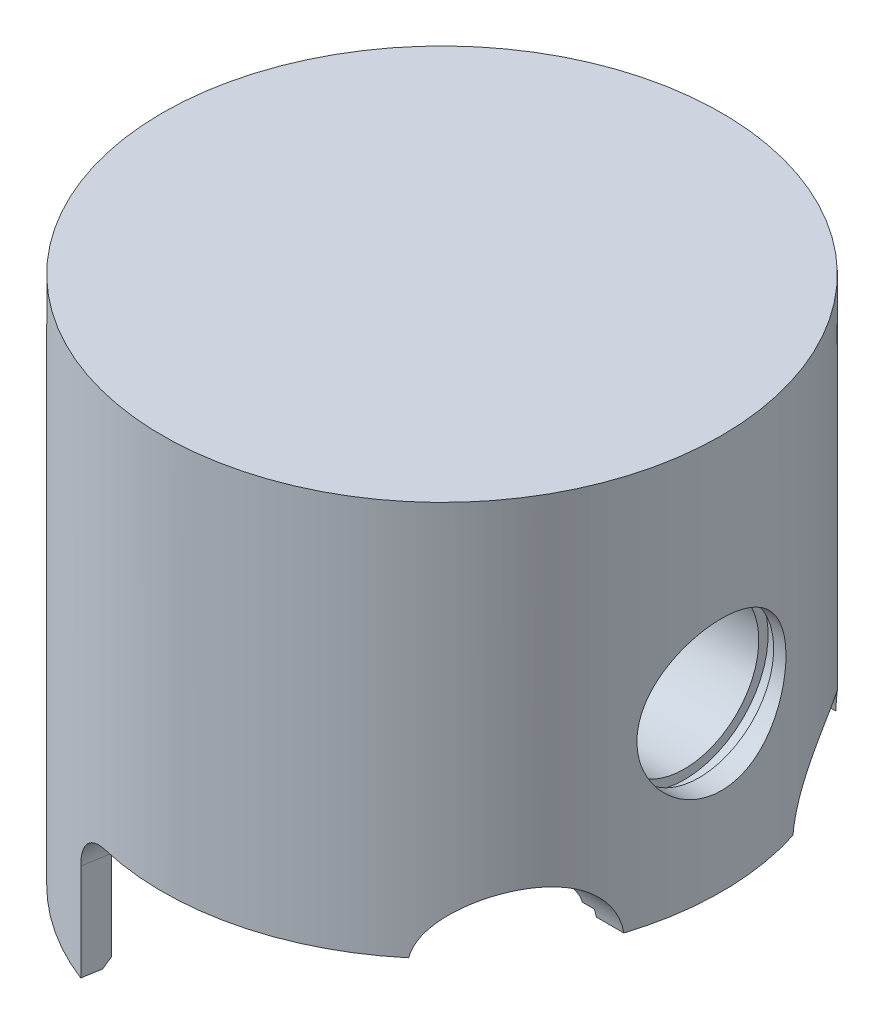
from build123d import *

# Parameters (mm, degrees)
CUT_EXTRUDE1_DEPTH      = 3.6
FILLET1_R               = 1
CUT_EXTRUDE2_START      = -10.1
CUT_EXTRUDE2_DEPTH      = 10.1
CUT_EXTRUDE3_DEPTH      = 18.7239952
CUT_EXTRUDE4_REACH      = 16.577
CUT_EXTRUDE4_END_RADIUS = 2
SKETCH6_R               = 0.5
CHAMFER1_SIZE           = 0.2


with BuildPart() as part:
    # Sketch1 → Revolve1 (revolve)
    with BuildSketch(Plane.XY, mode=Mode.PRIVATE) as revolve1_sk:
        with BuildLine():
            Line((0, 0), (7.5, 0))
            Line((7.5, 0), (7.5, -14.2))
            Line((7.5, -14.2), (7, -14.2))
            Line((7, -14.2), (6.8, -14))
            Line((6.8, -14), (6.8, -10.4))
            Line((6.8, -10.4), (6.5, -10.4))
            Line((6.5, -10.4), (6.5, -10.3))
            ThreePointArc((6.5, -10.3), (6.412132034, -10.087867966), (6.2, -10))
            Line((6.2, -10), (0, -10))
            Line((0, -10), (0, 0))
        make_face()
    revolve(revolve1_sk.sketch.rotate(Axis((0, -10, 0), (0, -1, 0)), 180), axis=Axis((0, -10, 0), (0, -1, 0)))

    # Sketch2 → Cut-Revolve1 (revolve, cut)
    with BuildSketch(Plane.XY, mode=Mode.PRIVATE) as cut_revolve1_sk:
        Polygon((-6.5, -4.25), (6.5, -4.25), (6.5, -4), (6.9, -4), (6.9, -4.25), (7.5, -4.25), (7.5, -6.25), (-7.5, -6.25), (-7.5, -4.25), (-6.9, -4.25), (-6.9, -4), (-6.5, -4), align=None)
    revolve(cut_revolve1_sk.sketch.rotate(Axis((7.5, -6.25, 0), (1, 0, 0)), 90), axis=Axis((7.5, -6.25, 0), (1, 0, 0)), mode=Mode.SUBTRACT)

    # Sketch3 → Cut-Extrude1 (cut)
    with BuildSketch(Plane.XZ.offset(14.2)):
        with BuildLine():
            Line((-2.574381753, 6.293850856), (-2.692582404, 7))
            ThreePointArc((-2.692582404, 7), (7.5, 0), (-2.692582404, -7))
            Line((-2.692582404, -7), (-2.574381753, -6.293850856))
            ThreePointArc((-2.574381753, -6.293850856), (6.8, 0), (-2.574381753, 6.293850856))
        make_face()
    extrude(amount=-CUT_EXTRUDE1_DEPTH, mode=Mode.SUBTRACT)

    # Fillet1
    fillet1_edges = [part.edges().sort_by_distance(p)[0] for p in [
        (-2.633482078, -10.6, -6.646925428),
        (-2.633482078, -10.6, 6.646925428),
    ]]
    fillet(fillet1_edges, radius=FILLET1_R)

    # Sketch4 → Cut-Extrude2 (cut)
    with BuildSketch(Plane.XZ.offset(10.6).offset(CUT_EXTRUDE2_START)):
        with BuildLine():
            Line((3, -2.5), (3, 2.5))
            ThreePointArc((3, 2.5), (4.423024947, 3.525658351), (3.9, 5.2))
            ThreePointArc((3.9, 5.2), (0, 6.5), (-3.9, 5.2))
            ThreePointArc((-3.9, 5.2), (-4.423024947, 3.525658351), (-3, 2.5))
            Line((-3, 2.5), (-3, -2.5))
            ThreePointArc((-3, -2.5), (-4.423024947, -3.525658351), (-3.9, -5.2))
            ThreePointArc((-3.9, -5.2), (0, -6.5), (3.9, -5.2))
            ThreePointArc((3.9, -5.2), (4.423024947, -3.525658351), (3, -2.5))
        make_face()
    extrude(amount=CUT_EXTRUDE2_DEPTH, mode=Mode.SUBTRACT)

    # Sketch5 → Cut-Extrude3 (cut, through all)
    with BuildSketch(Plane(origin=(0, 0, 0), x_dir=(0, 0, -1), z_dir=(1, 0, 0))):
        with BuildLine():
            Line((-2.267949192, -10.6), (2.267949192, -10.6))
            ThreePointArc((2.267949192, -10.6), (5.322875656, -9.704356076), (4, -12.6))
            Line((4, -12.6), (-4, -12.6))
            ThreePointArc((-4, -12.6), (-5.322875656, -9.704356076), (-2.267949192, -10.6))
        make_face()
    extrude(amount=CUT_EXTRUDE3_DEPTH, mode=Mode.SUBTRACT)

    # Cut-Extrude4: up to this cylinder (the profile starts outside it)
    cut_extrude4_end = Plane(origin=(0, -6.25, 0), z_dir=(-1, 0, 0)) * Cylinder(CUT_EXTRUDE4_END_RADIUS, 47.154, mode=Mode.PRIVATE)
    # Sketch6 → Cut-Extrude4 (cut, up to the surface)
    with BuildSketch(Plane.XZ.offset(10), mode=Mode.PRIVATE) as cut_extrude4_sk1:
        with Locations((-4.5, 0)):
            Circle(SKETCH6_R)
    cut_extrude4_tool1 = extrude(cut_extrude4_sk1.sketch, amount=-CUT_EXTRUDE4_REACH, mode=Mode.PRIVATE) - cut_extrude4_end
    add(cut_extrude4_tool1.solids().sort_by_distance((-4.5, -10, 0))[0], mode=Mode.SUBTRACT)
    # Sketch6 → Cut-Extrude4 (cut, up to the surface)
    with BuildSketch(Plane.XZ.offset(10), mode=Mode.PRIVATE) as cut_extrude4_sk2:
        with Locations((4.5, 0)):
            Circle(SKETCH6_R)
    cut_extrude4_tool2 = extrude(cut_extrude4_sk2.sketch, amount=-CUT_EXTRUDE4_REACH, mode=Mode.PRIVATE) - cut_extrude4_end
    add(cut_extrude4_tool2.solids().sort_by_distance((4.5, -10, 0))[0], mode=Mode.SUBTRACT)

    # Chamfer1
    chamfer1_edges = [part.edges().sort_by_distance(p)[0] for p in [
        (-5, -10, 0),
        (4, -10, 0),
    ]]
    chamfer(chamfer1_edges, length=CHAMFER1_SIZE)


solid = part.part
